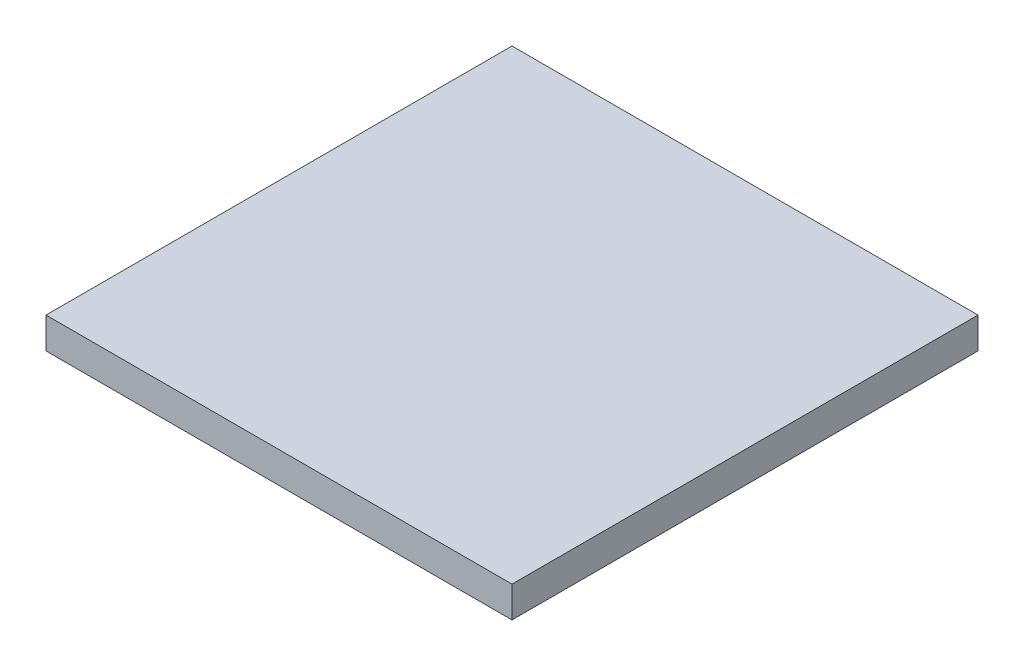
from build123d import *

# Parameters (mm, degrees)
ESQUISSE1_W        = 150
ESQUISSE1_H        = 150
BOSS_EXTRU_1_DEPTH = 10


with BuildPart() as part:
    # Esquisse1 → Boss.-Extru.1 (new body)
    with BuildSketch(Plane(origin=(0, 0, 0), x_dir=(1, 0, 0), z_dir=(0, 1, 0))):
        Rectangle(ESQUISSE1_W, ESQUISSE1_H)
    extrude(amount=-BOSS_EXTRU_1_DEPTH)


solid = part.part
